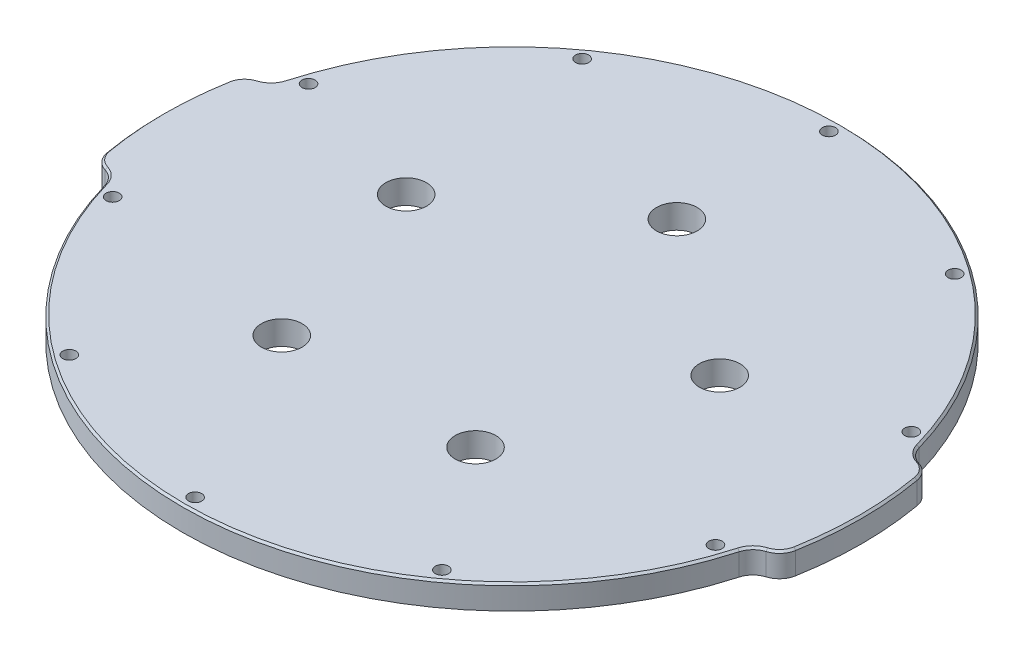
ISO-10303-21;
HEADER;
FILE_DESCRIPTION(('STEP AP214'),'2;1');
FILE_NAME('part.step','',(''),(''),'','','');
FILE_SCHEMA(('AUTOMOTIVE_DESIGN { 1 0 10303 214 1 1 1 1 }'));
ENDSEC;
DATA;
#1=APPLICATION_CONTEXT('core data for automotive mechanical design processes');
#2=APPLICATION_PROTOCOL_DEFINITION('international standard','automotive_design',2000,#1);
#3=PRODUCT_CONTEXT('',#1,'mechanical');
#4=PRODUCT('Part','Part','',(#3));
#5=PRODUCT_RELATED_PRODUCT_CATEGORY('part','',(#4));
#6=PRODUCT_DEFINITION_FORMATION('','',#4);
#7=PRODUCT_DEFINITION_CONTEXT('part definition',#1,'design');
#8=PRODUCT_DEFINITION('design','',#6,#7);
#9=PRODUCT_DEFINITION_SHAPE('','',#8);
#10=(LENGTH_UNIT() NAMED_UNIT(*) SI_UNIT(.MILLI.,.METRE.));
#11=(NAMED_UNIT(*) PLANE_ANGLE_UNIT() SI_UNIT($,.RADIAN.));
#12=(NAMED_UNIT(*) SI_UNIT($,.STERADIAN.) SOLID_ANGLE_UNIT());
#13=UNCERTAINTY_MEASURE_WITH_UNIT(LENGTH_MEASURE(1.E-05),#10,'distance_accuracy_value','');
#14=(GEOMETRIC_REPRESENTATION_CONTEXT(3) GLOBAL_UNCERTAINTY_ASSIGNED_CONTEXT((#13)) GLOBAL_UNIT_ASSIGNED_CONTEXT((#10,
#11,#12)) REPRESENTATION_CONTEXT('',''));
#15=CARTESIAN_POINT('',(0.,0.,0.));
#16=DIRECTION('',(0.,0.,1.));
#17=DIRECTION('',(1.,0.,0.));
#18=AXIS2_PLACEMENT_3D('',#15,#16,#17);
#19=CARTESIAN_POINT('',(-40.6479400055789,6.,-7.16732853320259));
#20=DIRECTION('',(0.,-1.,0.));
#21=DIRECTION('',(0.,0.,-1.));
#22=AXIS2_PLACEMENT_3D('',#19,#20,#21);
#23=PLANE('',#22);
#24=CARTESIAN_POINT('',(84.2258492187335,6.,-23.8957909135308));
#25=DIRECTION('',(0.,-1.,0.));
#26=DIRECTION('',(0.,0.,-1.));
#27=AXIS2_PLACEMENT_3D('',#24,#25,#26);
#28=CIRCLE('',#27,5.50000000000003);
#29=CARTESIAN_POINT('',(82.6143661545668,6.,-18.6371672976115));
#30=VERTEX_POINT('',#29);
#31=CARTESIAN_POINT('',(78.9346765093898,6.,-22.3946275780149));
#32=VERTEX_POINT('',#31);
#33=EDGE_CURVE('E295',#30,#32,#28,.T.);
#34=ORIENTED_EDGE('',*,*,#33,.T.);
#35=CARTESIAN_POINT('',(0.,6.,0.));
#36=DIRECTION('',(0.,-1.,0.));
#37=DIRECTION('',(0.,0.,-1.));
#38=AXIS2_PLACEMENT_3D('',#35,#36,#37);
#39=CIRCLE('',#38,82.05);
#40=CARTESIAN_POINT('',(-78.9346765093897,6.,-22.3946275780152));
#41=VERTEX_POINT('',#40);
#42=EDGE_CURVE('E301',#32,#41,#39,.F.);
#43=ORIENTED_EDGE('',*,*,#42,.T.);
#44=CARTESIAN_POINT('',(-84.2258492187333,6.,-23.8957909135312));
#45=DIRECTION('',(0.,-1.,0.));
#46=DIRECTION('',(0.,0.,-1.));
#47=AXIS2_PLACEMENT_3D('',#44,#45,#46);
#48=CIRCLE('',#47,5.50000000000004);
#49=CARTESIAN_POINT('',(-82.6143661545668,6.,-18.6371672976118));
#50=VERTEX_POINT('',#49);
#51=EDGE_CURVE('E298',#41,#50,#48,.T.);
#52=ORIENTED_EDGE('',*,*,#51,.T.);
#53=CARTESIAN_POINT('',(-81.2958800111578,6.,-14.3346570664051));
#54=DIRECTION('',(0.,-1.,0.));
#55=DIRECTION('',(0.,0.,-1.));
#56=AXIS2_PLACEMENT_3D('',#53,#54,#55);
#57=CIRCLE('',#56,4.49999999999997);
#58=CARTESIAN_POINT('',(-85.7275148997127,6.,-15.1160738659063));
#59=VERTEX_POINT('',#58);
#60=EDGE_CURVE('E292',#50,#59,#57,.F.);
#61=ORIENTED_EDGE('',*,*,#60,.T.);
#62=CARTESIAN_POINT('',(0.,6.,0.));
#63=DIRECTION('',(0.,-1.,0.));
#64=DIRECTION('',(0.,0.,-1.));
#65=AXIS2_PLACEMENT_3D('',#62,#63,#64);
#66=CIRCLE('',#65,87.05);
#67=CARTESIAN_POINT('',(-85.7275148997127,6.,15.1160738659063));
#68=VERTEX_POINT('',#67);
#69=EDGE_CURVE('E286',#59,#68,#66,.F.);
#70=ORIENTED_EDGE('',*,*,#69,.T.);
#71=CARTESIAN_POINT('',(-81.2958800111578,6.,14.3346570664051));
#72=DIRECTION('',(0.,-1.,0.));
#73=DIRECTION('',(0.,0.,-1.));
#74=AXIS2_PLACEMENT_3D('',#71,#72,#73);
#75=CIRCLE('',#74,4.49999999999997);
#76=CARTESIAN_POINT('',(-82.6143661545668,6.,18.6371672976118));
#77=VERTEX_POINT('',#76);
#78=EDGE_CURVE('E281',#68,#77,#75,.F.);
#79=ORIENTED_EDGE('',*,*,#78,.T.);
#80=CARTESIAN_POINT('',(-84.2258492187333,6.,23.8957909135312));
#81=DIRECTION('',(0.,-1.,0.));
#82=DIRECTION('',(0.,0.,-1.));
#83=AXIS2_PLACEMENT_3D('',#80,#81,#82);
#84=CIRCLE('',#83,5.50000000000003);
#85=CARTESIAN_POINT('',(-78.9346765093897,6.,22.3946275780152));
#86=VERTEX_POINT('',#85);
#87=EDGE_CURVE('E275',#77,#86,#84,.T.);
#88=ORIENTED_EDGE('',*,*,#87,.T.);
#89=CARTESIAN_POINT('',(0.,6.,-4.92661467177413E-13));
#90=DIRECTION('',(0.,-1.,0.));
#91=DIRECTION('',(0.,0.,-1.));
#92=AXIS2_PLACEMENT_3D('',#89,#90,#91);
#93=CIRCLE('',#92,82.0500000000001);
#94=CARTESIAN_POINT('',(78.9346765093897,6.,22.3946275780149));
#95=VERTEX_POINT('',#94);
#96=EDGE_CURVE('E269',#86,#95,#93,.F.);
#97=ORIENTED_EDGE('',*,*,#96,.T.);
#98=CARTESIAN_POINT('',(84.2258492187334,6.,23.8957909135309));
#99=DIRECTION('',(0.,-1.,0.));
#100=DIRECTION('',(0.,0.,-1.));
#101=AXIS2_PLACEMENT_3D('',#98,#99,#100);
#102=CIRCLE('',#101,5.50000000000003);
#103=CARTESIAN_POINT('',(82.6143661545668,6.,18.6371672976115));
#104=VERTEX_POINT('',#103);
#105=EDGE_CURVE('E272',#95,#104,#102,.T.);
#106=ORIENTED_EDGE('',*,*,#105,.T.);
#107=CARTESIAN_POINT('',(81.2958800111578,6.,14.3346570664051));
#108=DIRECTION('',(0.,-1.,0.));
#109=DIRECTION('',(0.,0.,-1.));
#110=AXIS2_PLACEMENT_3D('',#107,#108,#109);
#111=CIRCLE('',#110,4.49999999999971);
#112=CARTESIAN_POINT('',(85.7275148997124,6.,15.1160738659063));
#113=VERTEX_POINT('',#112);
#114=EDGE_CURVE('E278',#104,#113,#111,.F.);
#115=ORIENTED_EDGE('',*,*,#114,.T.);
#116=CARTESIAN_POINT('',(-1.29063426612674E-12,6.,0.));
#117=DIRECTION('',(0.,-1.,0.));
#118=DIRECTION('',(0.,0.,-1.));
#119=AXIS2_PLACEMENT_3D('',#116,#117,#118);
#120=CIRCLE('',#119,87.050000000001);
#121=CARTESIAN_POINT('',(85.7275148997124,6.,-15.1160738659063));
#122=VERTEX_POINT('',#121);
#123=EDGE_CURVE('E284',#113,#122,#120,.F.);
#124=ORIENTED_EDGE('',*,*,#123,.T.);
#125=CARTESIAN_POINT('',(81.2958800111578,6.,-14.3346570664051));
#126=DIRECTION('',(0.,-1.,0.));
#127=DIRECTION('',(0.,0.,-1.));
#128=AXIS2_PLACEMENT_3D('',#125,#126,#127);
#129=CIRCLE('',#128,4.49999999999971);
#130=EDGE_CURVE('E289',#122,#30,#129,.F.);
#131=ORIENTED_EDGE('',*,*,#130,.T.);
#132=EDGE_LOOP('',(#34,#43,#52,#61,#70,#79,#88,#97,#106,#115,#124,#131));
#133=FACE_BOUND('',#132,.T.);
#134=CARTESIAN_POINT('',(-39.2548577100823,6.,-12.7546764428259));
#135=DIRECTION('',(0.,1.,0.));
#136=DIRECTION('',(0.,0.,1.));
#137=AXIS2_PLACEMENT_3D('',#134,#135,#136);
#138=CIRCLE('',#137,5.1);
#139=CARTESIAN_POINT('',(-39.2548577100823,6.,-7.65467644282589));
#140=VERTEX_POINT('',#139);
#141=EDGE_CURVE('E384',#140,#140,#138,.T.);
#142=ORIENTED_EDGE('',*,*,#141,.F.);
#143=EDGE_LOOP('',(#142));
#144=FACE_BOUND('',#143,.T.);
#145=CARTESIAN_POINT('',(-24.2608362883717,6.,33.3921764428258));
#146=DIRECTION('',(0.,1.,0.));
#147=DIRECTION('',(0.,0.,1.));
#148=AXIS2_PLACEMENT_3D('',#145,#146,#147);
#149=CIRCLE('',#148,5.1);
#150=CARTESIAN_POINT('',(-24.2608362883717,6.,38.4921764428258));
#151=VERTEX_POINT('',#150);
#152=EDGE_CURVE('E397',#151,#151,#149,.T.);
#153=ORIENTED_EDGE('',*,*,#152,.F.);
#154=EDGE_LOOP('',(#153));
#155=FACE_BOUND('',#154,.T.);
#156=CARTESIAN_POINT('',(24.2608362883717,6.,33.3921764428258));
#157=DIRECTION('',(0.,1.,0.));
#158=DIRECTION('',(0.,0.,1.));
#159=AXIS2_PLACEMENT_3D('',#156,#157,#158);
#160=CIRCLE('',#159,5.1);
#161=CARTESIAN_POINT('',(24.2608362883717,6.,38.4921764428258));
#162=VERTEX_POINT('',#161);
#163=EDGE_CURVE('E404',#162,#162,#160,.T.);
#164=ORIENTED_EDGE('',*,*,#163,.F.);
#165=EDGE_LOOP('',(#164));
#166=FACE_BOUND('',#165,.T.);
#167=CARTESIAN_POINT('',(39.2548577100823,6.,-12.7546764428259));
#168=DIRECTION('',(0.,1.,0.));
#169=DIRECTION('',(0.,0.,1.));
#170=AXIS2_PLACEMENT_3D('',#167,#168,#169);
#171=CIRCLE('',#170,5.09999999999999);
#172=CARTESIAN_POINT('',(39.2548577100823,6.,-7.65467644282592));
#173=VERTEX_POINT('',#172);
#174=EDGE_CURVE('E411',#173,#173,#171,.T.);
#175=ORIENTED_EDGE('',*,*,#174,.F.);
#176=EDGE_LOOP('',(#175));
#177=FACE_BOUND('',#176,.T.);
#178=CARTESIAN_POINT('',(0.,6.,-41.2749999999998));
#179=DIRECTION('',(0.,1.,0.));
#180=DIRECTION('',(0.,0.,1.));
#181=AXIS2_PLACEMENT_3D('',#178,#179,#180);
#182=CIRCLE('',#181,5.1);
#183=CARTESIAN_POINT('',(0.,6.,-36.1749999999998));
#184=VERTEX_POINT('',#183);
#185=EDGE_CURVE('E419',#184,#184,#182,.T.);
#186=ORIENTED_EDGE('',*,*,#185,.F.);
#187=EDGE_LOOP('',(#186));
#188=FACE_BOUND('',#187,.T.);
#189=CARTESIAN_POINT('',(-75.4663345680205,6.,-24.5204985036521));
#190=DIRECTION('',(0.,1.,0.));
#191=DIRECTION('',(0.,0.,1.));
#192=AXIS2_PLACEMENT_3D('',#189,#190,#191);
#193=CIRCLE('',#192,1.6500000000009);
#194=CARTESIAN_POINT('',(-75.4663345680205,6.,-22.8704985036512));
#195=VERTEX_POINT('',#194);
#196=EDGE_CURVE('E439',#195,#195,#193,.T.);
#197=ORIENTED_EDGE('',*,*,#196,.F.);
#198=EDGE_LOOP('',(#197));
#199=FACE_BOUND('',#198,.T.);
#200=CARTESIAN_POINT('',(-46.6407597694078,6.,64.1954985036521));
#201=DIRECTION('',(0.,1.,0.));
#202=DIRECTION('',(0.,0.,1.));
#203=AXIS2_PLACEMENT_3D('',#200,#201,#202);
#204=CIRCLE('',#203,1.65000000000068);
#205=CARTESIAN_POINT('',(-46.6407597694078,6.,65.8454985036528));
#206=VERTEX_POINT('',#205);
#207=EDGE_CURVE('E455',#206,#206,#204,.T.);
#208=ORIENTED_EDGE('',*,*,#207,.F.);
#209=EDGE_LOOP('',(#208));
#210=FACE_BOUND('',#209,.T.);
#211=CARTESIAN_POINT('',(46.6407597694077,6.,64.1954985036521));
#212=DIRECTION('',(0.,1.,0.));
#213=DIRECTION('',(0.,0.,1.));
#214=AXIS2_PLACEMENT_3D('',#211,#212,#213);
#215=CIRCLE('',#214,1.65000000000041);
#216=CARTESIAN_POINT('',(46.6407597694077,6.,65.8454985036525));
#217=VERTEX_POINT('',#216);
#218=EDGE_CURVE('E471',#217,#217,#215,.T.);
#219=ORIENTED_EDGE('',*,*,#218,.F.);
#220=EDGE_LOOP('',(#219));
#221=FACE_BOUND('',#220,.T.);
#222=CARTESIAN_POINT('',(75.4663345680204,6.,-24.5204985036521));
#223=DIRECTION('',(0.,1.,0.));
#224=DIRECTION('',(0.,0.,1.));
#225=AXIS2_PLACEMENT_3D('',#222,#223,#224);
#226=CIRCLE('',#225,1.65000000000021);
#227=CARTESIAN_POINT('',(75.4663345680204,6.,-22.8704985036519));
#228=VERTEX_POINT('',#227);
#229=EDGE_CURVE('E487',#228,#228,#226,.T.);
#230=ORIENTED_EDGE('',*,*,#229,.F.);
#231=EDGE_LOOP('',(#230));
#232=FACE_BOUND('',#231,.T.);
#233=CARTESIAN_POINT('',(0.,6.,-79.35));
#234=DIRECTION('',(0.,1.,0.));
#235=DIRECTION('',(0.,0.,1.));
#236=AXIS2_PLACEMENT_3D('',#233,#234,#235);
#237=CIRCLE('',#236,1.65);
#238=CARTESIAN_POINT('',(0.,6.,-77.7));
#239=VERTEX_POINT('',#238);
#240=EDGE_CURVE('E191',#239,#239,#237,.T.);
#241=ORIENTED_EDGE('',*,*,#240,.F.);
#242=EDGE_LOOP('',(#241));
#243=FACE_BOUND('',#242,.T.);
#244=CARTESIAN_POINT('',(46.6407597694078,6.,-64.1954985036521));
#245=DIRECTION('',(0.,1.,0.));
#246=DIRECTION('',(0.,0.,1.));
#247=AXIS2_PLACEMENT_3D('',#244,#245,#246);
#248=CIRCLE('',#247,1.65000000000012);
#249=CARTESIAN_POINT('',(46.6407597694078,6.,-62.5454985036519));
#250=VERTEX_POINT('',#249);
#251=EDGE_CURVE('E495',#250,#250,#248,.T.);
#252=ORIENTED_EDGE('',*,*,#251,.F.);
#253=EDGE_LOOP('',(#252));
#254=FACE_BOUND('',#253,.T.);
#255=CARTESIAN_POINT('',(75.4663345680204,6.,24.5204985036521));
#256=DIRECTION('',(0.,1.,0.));
#257=DIRECTION('',(0.,0.,1.));
#258=AXIS2_PLACEMENT_3D('',#255,#256,#257);
#259=CIRCLE('',#258,1.65000000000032);
#260=CARTESIAN_POINT('',(75.4663345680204,6.,26.1704985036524));
#261=VERTEX_POINT('',#260);
#262=EDGE_CURVE('E479',#261,#261,#259,.T.);
#263=ORIENTED_EDGE('',*,*,#262,.F.);
#264=EDGE_LOOP('',(#263));
#265=FACE_BOUND('',#264,.T.);
#266=CARTESIAN_POINT('',(0.,6.,79.35));
#267=DIRECTION('',(0.,1.,0.));
#268=DIRECTION('',(0.,0.,1.));
#269=AXIS2_PLACEMENT_3D('',#266,#267,#268);
#270=CIRCLE('',#269,1.65000000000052);
#271=CARTESIAN_POINT('',(0.,6.,81.0000000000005));
#272=VERTEX_POINT('',#271);
#273=EDGE_CURVE('E463',#272,#272,#270,.T.);
#274=ORIENTED_EDGE('',*,*,#273,.F.);
#275=EDGE_LOOP('',(#274));
#276=FACE_BOUND('',#275,.T.);
#277=CARTESIAN_POINT('',(-75.4663345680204,6.,24.5204985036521));
#278=DIRECTION('',(0.,1.,0.));
#279=DIRECTION('',(0.,0.,1.));
#280=AXIS2_PLACEMENT_3D('',#277,#278,#279);
#281=CIRCLE('',#280,1.65000000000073);
#282=CARTESIAN_POINT('',(-75.4663345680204,6.,26.1704985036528));
#283=VERTEX_POINT('',#282);
#284=EDGE_CURVE('E447',#283,#283,#281,.T.);
#285=ORIENTED_EDGE('',*,*,#284,.F.);
#286=EDGE_LOOP('',(#285));
#287=FACE_BOUND('',#286,.T.);
#288=CARTESIAN_POINT('',(-46.6407597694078,6.,-64.1954985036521));
#289=DIRECTION('',(0.,1.,0.));
#290=DIRECTION('',(0.,0.,1.));
#291=AXIS2_PLACEMENT_3D('',#288,#289,#290);
#292=CIRCLE('',#291,1.65000000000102);
#293=CARTESIAN_POINT('',(-46.6407597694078,6.,-62.545498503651));
#294=VERTEX_POINT('',#293);
#295=EDGE_CURVE('E431',#294,#294,#292,.T.);
#296=ORIENTED_EDGE('',*,*,#295,.F.);
#297=EDGE_LOOP('',(#296));
#298=FACE_BOUND('',#297,.T.);
#299=ADVANCED_FACE('F41',(#133,#144,#155,#166,#177,#188,#199,#210,#221,#232,#243,#254,#265,#276,
#287,#298),#23,.F.);
#300=CARTESIAN_POINT('',(-40.6479400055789,0.,-7.16732853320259));
#301=DIRECTION('',(0.,-1.,0.));
#302=DIRECTION('',(0.,0.,-1.));
#303=AXIS2_PLACEMENT_3D('',#300,#301,#302);
#304=PLANE('',#303);
#305=CARTESIAN_POINT('',(-39.2548577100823,0.,-12.7546764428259));
#306=DIRECTION('',(0.,1.,0.));
#307=DIRECTION('',(0.,0.,1.));
#308=AXIS2_PLACEMENT_3D('',#305,#306,#307);
#309=CIRCLE('',#308,5.1);
#310=CARTESIAN_POINT('',(-39.2548577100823,0.,-7.65467644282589));
#311=VERTEX_POINT('',#310);
#312=EDGE_CURVE('E390',#311,#311,#309,.T.);
#313=ORIENTED_EDGE('',*,*,#312,.T.);
#314=EDGE_LOOP('',(#313));
#315=FACE_BOUND('',#314,.T.);
#316=CARTESIAN_POINT('',(-24.2608362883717,0.,33.3921764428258));
#317=DIRECTION('',(0.,1.,0.));
#318=DIRECTION('',(0.,0.,1.));
#319=AXIS2_PLACEMENT_3D('',#316,#317,#318);
#320=CIRCLE('',#319,5.1);
#321=CARTESIAN_POINT('',(-24.2608362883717,0.,38.4921764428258));
#322=VERTEX_POINT('',#321);
#323=EDGE_CURVE('E400',#322,#322,#320,.T.);
#324=ORIENTED_EDGE('',*,*,#323,.T.);
#325=EDGE_LOOP('',(#324));
#326=FACE_BOUND('',#325,.T.);
#327=CARTESIAN_POINT('',(24.2608362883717,0.,33.3921764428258));
#328=DIRECTION('',(0.,1.,0.));
#329=DIRECTION('',(0.,0.,1.));
#330=AXIS2_PLACEMENT_3D('',#327,#328,#329);
#331=CIRCLE('',#330,5.1);
#332=CARTESIAN_POINT('',(24.2608362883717,0.,38.4921764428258));
#333=VERTEX_POINT('',#332);
#334=EDGE_CURVE('E408',#333,#333,#331,.T.);
#335=ORIENTED_EDGE('',*,*,#334,.T.);
#336=EDGE_LOOP('',(#335));
#337=FACE_BOUND('',#336,.T.);
#338=CARTESIAN_POINT('',(39.2548577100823,0.,-12.7546764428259));
#339=DIRECTION('',(0.,1.,0.));
#340=DIRECTION('',(0.,0.,1.));
#341=AXIS2_PLACEMENT_3D('',#338,#339,#340);
#342=CIRCLE('',#341,5.09999999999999);
#343=CARTESIAN_POINT('',(39.2548577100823,0.,-7.65467644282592));
#344=VERTEX_POINT('',#343);
#345=EDGE_CURVE('E415',#344,#344,#342,.T.);
#346=ORIENTED_EDGE('',*,*,#345,.T.);
#347=EDGE_LOOP('',(#346));
#348=FACE_BOUND('',#347,.T.);
#349=CARTESIAN_POINT('',(0.,0.,-41.2749999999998));
#350=DIRECTION('',(0.,1.,0.));
#351=DIRECTION('',(0.,0.,1.));
#352=AXIS2_PLACEMENT_3D('',#349,#350,#351);
#353=CIRCLE('',#352,5.1);
#354=CARTESIAN_POINT('',(0.,0.,-36.1749999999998));
#355=VERTEX_POINT('',#354);
#356=EDGE_CURVE('E423',#355,#355,#353,.T.);
#357=ORIENTED_EDGE('',*,*,#356,.T.);
#358=EDGE_LOOP('',(#357));
#359=FACE_BOUND('',#358,.T.);
#360=CARTESIAN_POINT('',(-75.4663345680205,0.,-24.5204985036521));
#361=DIRECTION('',(0.,1.,0.));
#362=DIRECTION('',(0.,0.,1.));
#363=AXIS2_PLACEMENT_3D('',#360,#361,#362);
#364=CIRCLE('',#363,1.6500000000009);
#365=CARTESIAN_POINT('',(-75.4663345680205,0.,-22.8704985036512));
#366=VERTEX_POINT('',#365);
#367=EDGE_CURVE('E435',#366,#366,#364,.T.);
#368=ORIENTED_EDGE('',*,*,#367,.T.);
#369=EDGE_LOOP('',(#368));
#370=FACE_BOUND('',#369,.T.);
#371=CARTESIAN_POINT('',(-46.6407597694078,0.,64.1954985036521));
#372=DIRECTION('',(0.,1.,0.));
#373=DIRECTION('',(0.,0.,1.));
#374=AXIS2_PLACEMENT_3D('',#371,#372,#373);
#375=CIRCLE('',#374,1.65000000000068);
#376=CARTESIAN_POINT('',(-46.6407597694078,0.,65.8454985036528));
#377=VERTEX_POINT('',#376);
#378=EDGE_CURVE('E451',#377,#377,#375,.T.);
#379=ORIENTED_EDGE('',*,*,#378,.T.);
#380=EDGE_LOOP('',(#379));
#381=FACE_BOUND('',#380,.T.);
#382=CARTESIAN_POINT('',(46.6407597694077,0.,64.1954985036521));
#383=DIRECTION('',(0.,1.,0.));
#384=DIRECTION('',(0.,0.,1.));
#385=AXIS2_PLACEMENT_3D('',#382,#383,#384);
#386=CIRCLE('',#385,1.65000000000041);
#387=CARTESIAN_POINT('',(46.6407597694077,0.,65.8454985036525));
#388=VERTEX_POINT('',#387);
#389=EDGE_CURVE('E467',#388,#388,#386,.T.);
#390=ORIENTED_EDGE('',*,*,#389,.T.);
#391=EDGE_LOOP('',(#390));
#392=FACE_BOUND('',#391,.T.);
#393=CARTESIAN_POINT('',(75.4663345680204,0.,-24.5204985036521));
#394=DIRECTION('',(0.,1.,0.));
#395=DIRECTION('',(0.,0.,1.));
#396=AXIS2_PLACEMENT_3D('',#393,#394,#395);
#397=CIRCLE('',#396,1.65000000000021);
#398=CARTESIAN_POINT('',(75.4663345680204,0.,-22.8704985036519));
#399=VERTEX_POINT('',#398);
#400=EDGE_CURVE('E483',#399,#399,#397,.T.);
#401=ORIENTED_EDGE('',*,*,#400,.T.);
#402=EDGE_LOOP('',(#401));
#403=FACE_BOUND('',#402,.T.);
#404=CARTESIAN_POINT('',(0.,0.,-79.35));
#405=DIRECTION('',(0.,1.,0.));
#406=DIRECTION('',(0.,0.,1.));
#407=AXIS2_PLACEMENT_3D('',#404,#405,#406);
#408=CIRCLE('',#407,1.65);
#409=CARTESIAN_POINT('',(0.,0.,-77.7));
#410=VERTEX_POINT('',#409);
#411=EDGE_CURVE('E499',#410,#410,#408,.T.);
#412=ORIENTED_EDGE('',*,*,#411,.T.);
#413=EDGE_LOOP('',(#412));
#414=FACE_BOUND('',#413,.T.);
#415=CARTESIAN_POINT('',(-81.2958800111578,0.,-14.3346570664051));
#416=DIRECTION('',(0.,1.,0.));
#417=DIRECTION('',(0.,0.,-1.));
#418=AXIS2_PLACEMENT_3D('',#415,#416,#417);
#419=CIRCLE('',#418,5.00000000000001);
#420=CARTESIAN_POINT('',(-82.7608646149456,0.,-19.1152239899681));
#421=VERTEX_POINT('',#420);
#422=CARTESIAN_POINT('',(-86.2199187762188,0.,-15.2028979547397));
#423=VERTEX_POINT('',#422);
#424=EDGE_CURVE('E184',#421,#423,#419,.T.);
#425=ORIENTED_EDGE('',*,*,#424,.F.);
#426=CARTESIAN_POINT('',(-84.2258492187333,0.,-23.8957909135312));
#427=DIRECTION('',(0.,-1.,0.));
#428=DIRECTION('',(0.,0.,-1.));
#429=AXIS2_PLACEMENT_3D('',#426,#427,#428);
#430=CIRCLE('',#429,5.);
#431=CARTESIAN_POINT('',(-79.4156922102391,0.,-22.531096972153));
#432=VERTEX_POINT('',#431);
#433=EDGE_CURVE('E263',#421,#432,#430,.F.);
#434=ORIENTED_EDGE('',*,*,#433,.T.);
#435=CARTESIAN_POINT('',(0.,0.,0.));
#436=DIRECTION('',(0.,1.,0.));
#437=DIRECTION('',(0.,0.,-1.));
#438=AXIS2_PLACEMENT_3D('',#435,#436,#437);
#439=CIRCLE('',#438,82.55);
#440=CARTESIAN_POINT('',(79.4156922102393,0.,-22.5310969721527));
#441=VERTEX_POINT('',#440);
#442=EDGE_CURVE('E220',#441,#432,#439,.T.);
#443=ORIENTED_EDGE('',*,*,#442,.F.);
#444=CARTESIAN_POINT('',(84.2258492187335,0.,-23.8957909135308));
#445=DIRECTION('',(0.,-1.,0.));
#446=DIRECTION('',(0.,0.,-1.));
#447=AXIS2_PLACEMENT_3D('',#444,#445,#446);
#448=CIRCLE('',#447,5.);
#449=CARTESIAN_POINT('',(82.7608646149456,0.,-19.1152239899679));
#450=VERTEX_POINT('',#449);
#451=EDGE_CURVE('E260',#441,#450,#448,.F.);
#452=ORIENTED_EDGE('',*,*,#451,.T.);
#453=CARTESIAN_POINT('',(81.2958800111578,0.,-14.3346570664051));
#454=DIRECTION('',(0.,1.,0.));
#455=DIRECTION('',(0.,0.,1.));
#456=AXIS2_PLACEMENT_3D('',#453,#454,#455);
#457=CIRCLE('',#456,4.99999999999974);
#458=CARTESIAN_POINT('',(86.2199187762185,0.,-15.2028979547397));
#459=VERTEX_POINT('',#458);
#460=EDGE_CURVE('E216',#459,#450,#457,.T.);
#461=ORIENTED_EDGE('',*,*,#460,.F.);
#462=CARTESIAN_POINT('',(-1.29063426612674E-12,0.,0.));
#463=DIRECTION('',(0.,1.,0.));
#464=DIRECTION('',(0.,0.,1.));
#465=AXIS2_PLACEMENT_3D('',#462,#463,#464);
#466=CIRCLE('',#465,87.550000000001);
#467=CARTESIAN_POINT('',(86.2199187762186,0.,15.2028979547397));
#468=VERTEX_POINT('',#467);
#469=EDGE_CURVE('E212',#468,#459,#466,.T.);
#470=ORIENTED_EDGE('',*,*,#469,.F.);
#471=CARTESIAN_POINT('',(81.2958800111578,0.,14.3346570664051));
#472=DIRECTION('',(0.,1.,0.));
#473=DIRECTION('',(0.,0.,-1.));
#474=AXIS2_PLACEMENT_3D('',#471,#472,#473);
#475=CIRCLE('',#474,4.99999999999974);
#476=CARTESIAN_POINT('',(82.7608646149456,0.,19.1152239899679));
#477=VERTEX_POINT('',#476);
#478=EDGE_CURVE('E208',#477,#468,#475,.T.);
#479=ORIENTED_EDGE('',*,*,#478,.F.);
#480=CARTESIAN_POINT('',(84.2258492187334,0.,23.8957909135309));
#481=DIRECTION('',(0.,-1.,0.));
#482=DIRECTION('',(0.,0.,-1.));
#483=AXIS2_PLACEMENT_3D('',#480,#481,#482);
#484=CIRCLE('',#483,5.);
#485=CARTESIAN_POINT('',(79.4156922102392,0.,22.5310969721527));
#486=VERTEX_POINT('',#485);
#487=EDGE_CURVE('E257',#477,#486,#484,.F.);
#488=ORIENTED_EDGE('',*,*,#487,.T.);
#489=CARTESIAN_POINT('',(0.,0.,-4.92661467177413E-13));
#490=DIRECTION('',(0.,1.,0.));
#491=DIRECTION('',(0.,0.,-1.));
#492=AXIS2_PLACEMENT_3D('',#489,#490,#491);
#493=CIRCLE('',#492,82.5500000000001);
#494=CARTESIAN_POINT('',(-79.4156922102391,0.,22.531096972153));
#495=VERTEX_POINT('',#494);
#496=EDGE_CURVE('E201',#495,#486,#493,.T.);
#497=ORIENTED_EDGE('',*,*,#496,.F.);
#498=CARTESIAN_POINT('',(-84.2258492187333,0.,23.8957909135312));
#499=DIRECTION('',(0.,-1.,0.));
#500=DIRECTION('',(0.,0.,-1.));
#501=AXIS2_PLACEMENT_3D('',#498,#499,#500);
#502=CIRCLE('',#501,5.);
#503=CARTESIAN_POINT('',(-82.7608646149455,0.,19.1152239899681));
#504=VERTEX_POINT('',#503);
#505=EDGE_CURVE('E266',#495,#504,#502,.F.);
#506=ORIENTED_EDGE('',*,*,#505,.T.);
#507=CARTESIAN_POINT('',(-81.2958800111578,0.,14.3346570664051));
#508=DIRECTION('',(0.,1.,0.));
#509=DIRECTION('',(0.,0.,1.));
#510=AXIS2_PLACEMENT_3D('',#507,#508,#509);
#511=CIRCLE('',#510,5.00000000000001);
#512=CARTESIAN_POINT('',(-86.2199187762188,0.,15.2028979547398));
#513=VERTEX_POINT('',#512);
#514=EDGE_CURVE('E196',#513,#504,#511,.T.);
#515=ORIENTED_EDGE('',*,*,#514,.F.);
#516=CARTESIAN_POINT('',(0.,0.,0.));
#517=DIRECTION('',(0.,1.,0.));
#518=DIRECTION('',(0.,0.,-1.));
#519=AXIS2_PLACEMENT_3D('',#516,#517,#518);
#520=CIRCLE('',#519,87.55);
#521=EDGE_CURVE('E173',#423,#513,#520,.T.);
#522=ORIENTED_EDGE('',*,*,#521,.F.);
#523=EDGE_LOOP('',(#425,#434,#443,#452,#461,#470,#479,#488,#497,#506,#515,#522));
#524=FACE_BOUND('',#523,.T.);
#525=CARTESIAN_POINT('',(46.6407597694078,0.,-64.1954985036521));
#526=DIRECTION('',(0.,1.,0.));
#527=DIRECTION('',(0.,0.,1.));
#528=AXIS2_PLACEMENT_3D('',#525,#526,#527);
#529=CIRCLE('',#528,1.65000000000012);
#530=CARTESIAN_POINT('',(46.6407597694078,0.,-62.5454985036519));
#531=VERTEX_POINT('',#530);
#532=EDGE_CURVE('E491',#531,#531,#529,.T.);
#533=ORIENTED_EDGE('',*,*,#532,.T.);
#534=EDGE_LOOP('',(#533));
#535=FACE_BOUND('',#534,.T.);
#536=CARTESIAN_POINT('',(75.4663345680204,0.,24.5204985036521));
#537=DIRECTION('',(0.,1.,0.));
#538=DIRECTION('',(0.,0.,1.));
#539=AXIS2_PLACEMENT_3D('',#536,#537,#538);
#540=CIRCLE('',#539,1.65000000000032);
#541=CARTESIAN_POINT('',(75.4663345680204,0.,26.1704985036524));
#542=VERTEX_POINT('',#541);
#543=EDGE_CURVE('E475',#542,#542,#540,.T.);
#544=ORIENTED_EDGE('',*,*,#543,.T.);
#545=EDGE_LOOP('',(#544));
#546=FACE_BOUND('',#545,.T.);
#547=CARTESIAN_POINT('',(0.,0.,79.35));
#548=DIRECTION('',(0.,1.,0.));
#549=DIRECTION('',(0.,0.,1.));
#550=AXIS2_PLACEMENT_3D('',#547,#548,#549);
#551=CIRCLE('',#550,1.65000000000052);
#552=CARTESIAN_POINT('',(0.,0.,81.0000000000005));
#553=VERTEX_POINT('',#552);
#554=EDGE_CURVE('E459',#553,#553,#551,.T.);
#555=ORIENTED_EDGE('',*,*,#554,.T.);
#556=EDGE_LOOP('',(#555));
#557=FACE_BOUND('',#556,.T.);
#558=CARTESIAN_POINT('',(-75.4663345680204,0.,24.5204985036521));
#559=DIRECTION('',(0.,1.,0.));
#560=DIRECTION('',(0.,0.,1.));
#561=AXIS2_PLACEMENT_3D('',#558,#559,#560);
#562=CIRCLE('',#561,1.65000000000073);
#563=CARTESIAN_POINT('',(-75.4663345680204,0.,26.1704985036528));
#564=VERTEX_POINT('',#563);
#565=EDGE_CURVE('E443',#564,#564,#562,.T.);
#566=ORIENTED_EDGE('',*,*,#565,.T.);
#567=EDGE_LOOP('',(#566));
#568=FACE_BOUND('',#567,.T.);
#569=CARTESIAN_POINT('',(-46.6407597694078,0.,-64.1954985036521));
#570=DIRECTION('',(0.,1.,0.));
#571=DIRECTION('',(0.,0.,1.));
#572=AXIS2_PLACEMENT_3D('',#569,#570,#571);
#573=CIRCLE('',#572,1.65000000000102);
#574=CARTESIAN_POINT('',(-46.6407597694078,0.,-62.545498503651));
#575=VERTEX_POINT('',#574);
#576=EDGE_CURVE('E427',#575,#575,#573,.T.);
#577=ORIENTED_EDGE('',*,*,#576,.T.);
#578=EDGE_LOOP('',(#577));
#579=FACE_BOUND('',#578,.T.);
#580=ADVANCED_FACE('F193',(#315,#326,#337,#348,#359,#370,#381,#392,#403,#414,#524,#535,#546,
#557,#568,#579),#304,.T.);
#581=CARTESIAN_POINT('',(-81.2958800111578,6.,-14.3346570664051));
#582=DIRECTION('',(0.,-1.,0.));
#583=DIRECTION('',(0.,0.,-1.));
#584=AXIS2_PLACEMENT_3D('',#581,#582,#583);
#585=CYLINDRICAL_SURFACE('',#584,5.00000000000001);
#586=DIRECTION('',(0.,-1.,0.));
#587=VECTOR('',#586,1.);
#588=CARTESIAN_POINT('',(-86.2199187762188,6.,-15.2028979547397));
#589=LINE('',#588,#587);
#590=CARTESIAN_POINT('',(-86.2199187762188,5.49999999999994,-15.2028979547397));
#591=VERTEX_POINT('',#590);
#592=EDGE_CURVE('E168',#591,#423,#589,.T.);
#593=ORIENTED_EDGE('',*,*,#592,.F.);
#594=CARTESIAN_POINT('',(-81.2958800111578,5.49999999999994,-14.3346570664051));
#595=DIRECTION('',(0.,-1.,0.));
#596=DIRECTION('',(0.,0.,-1.));
#597=AXIS2_PLACEMENT_3D('',#594,#595,#596);
#598=CIRCLE('',#597,5.00000000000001);
#599=CARTESIAN_POINT('',(-82.7608646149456,5.49999999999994,-19.1152239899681));
#600=VERTEX_POINT('',#599);
#601=EDGE_CURVE('E315',#591,#600,#598,.T.);
#602=ORIENTED_EDGE('',*,*,#601,.T.);
#603=DIRECTION('',(0.,-1.,0.));
#604=VECTOR('',#603,1.);
#605=CARTESIAN_POINT('',(-82.7608646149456,6.,-19.1152239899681));
#606=LINE('',#605,#604);
#607=EDGE_CURVE('E187',#600,#421,#606,.T.);
#608=ORIENTED_EDGE('',*,*,#607,.T.);
#609=ORIENTED_EDGE('',*,*,#424,.T.);
#610=EDGE_LOOP('',(#593,#602,#608,#609));
#611=FACE_BOUND('',#610,.T.);
#612=ADVANCED_FACE('F185',(#611),#585,.T.);
#613=CARTESIAN_POINT('',(0.,6.,0.));
#614=DIRECTION('',(0.,-1.,0.));
#615=DIRECTION('',(0.,0.,-1.));
#616=AXIS2_PLACEMENT_3D('',#613,#614,#615);
#617=CYLINDRICAL_SURFACE('',#616,87.55);
#618=DIRECTION('',(0.,-1.,0.));
#619=VECTOR('',#618,1.);
#620=CARTESIAN_POINT('',(-86.2199187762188,6.,15.2028979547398));
#621=LINE('',#620,#619);
#622=CARTESIAN_POINT('',(-86.2199187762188,5.49999999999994,15.2028979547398));
#623=VERTEX_POINT('',#622);
#624=EDGE_CURVE('E181',#623,#513,#621,.T.);
#625=ORIENTED_EDGE('',*,*,#624,.F.);
#626=CARTESIAN_POINT('',(0.,5.49999999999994,0.));
#627=DIRECTION('',(0.,-1.,0.));
#628=DIRECTION('',(0.,0.,-1.));
#629=AXIS2_PLACEMENT_3D('',#626,#627,#628);
#630=CIRCLE('',#629,87.55);
#631=EDGE_CURVE('E176',#623,#591,#630,.T.);
#632=ORIENTED_EDGE('',*,*,#631,.T.);
#633=ORIENTED_EDGE('',*,*,#592,.T.);
#634=ORIENTED_EDGE('',*,*,#521,.T.);
#635=EDGE_LOOP('',(#625,#632,#633,#634));
#636=FACE_BOUND('',#635,.T.);
#637=ADVANCED_FACE('F171',(#636),#617,.T.);
#638=CARTESIAN_POINT('',(-81.2958800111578,6.,14.3346570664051));
#639=DIRECTION('',(0.,-1.,0.));
#640=DIRECTION('',(0.,0.,-1.));
#641=AXIS2_PLACEMENT_3D('',#638,#639,#640);
#642=CYLINDRICAL_SURFACE('',#641,5.00000000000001);
#643=DIRECTION('',(0.,-1.,0.));
#644=VECTOR('',#643,1.);
#645=CARTESIAN_POINT('',(-82.7608646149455,6.,19.1152239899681));
#646=LINE('',#645,#644);
#647=CARTESIAN_POINT('',(-82.7608646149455,5.49999999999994,19.1152239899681));
#648=VERTEX_POINT('',#647);
#649=EDGE_CURVE('E253',#504,#648,#646,.F.);
#650=ORIENTED_EDGE('',*,*,#649,.T.);
#651=CARTESIAN_POINT('',(-81.2958800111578,5.49999999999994,14.3346570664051));
#652=DIRECTION('',(0.,-1.,0.));
#653=DIRECTION('',(0.,0.,-1.));
#654=AXIS2_PLACEMENT_3D('',#651,#652,#653);
#655=CIRCLE('',#654,5.00000000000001);
#656=EDGE_CURVE('E326',#648,#623,#655,.T.);
#657=ORIENTED_EDGE('',*,*,#656,.T.);
#658=ORIENTED_EDGE('',*,*,#624,.T.);
#659=ORIENTED_EDGE('',*,*,#514,.T.);
#660=EDGE_LOOP('',(#650,#657,#658,#659));
#661=FACE_BOUND('',#660,.T.);
#662=ADVANCED_FACE('F549',(#661),#642,.T.);
#663=CARTESIAN_POINT('',(0.,6.,-4.92661467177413E-13));
#664=DIRECTION('',(0.,-1.,0.));
#665=DIRECTION('',(0.,0.,-1.));
#666=AXIS2_PLACEMENT_3D('',#663,#664,#665);
#667=CYLINDRICAL_SURFACE('',#666,82.5500000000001);
#668=DIRECTION('',(0.,-1.,0.));
#669=VECTOR('',#668,1.);
#670=CARTESIAN_POINT('',(79.4156922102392,6.,22.5310969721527));
#671=LINE('',#670,#669);
#672=CARTESIAN_POINT('',(79.4156922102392,5.49999999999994,22.5310969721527));
#673=VERTEX_POINT('',#672);
#674=EDGE_CURVE('E237',#486,#673,#671,.F.);
#675=ORIENTED_EDGE('',*,*,#674,.T.);
#676=CARTESIAN_POINT('',(0.,5.49999999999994,-4.92661467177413E-13));
#677=DIRECTION('',(0.,-1.,0.));
#678=DIRECTION('',(0.,0.,-1.));
#679=AXIS2_PLACEMENT_3D('',#676,#677,#678);
#680=CIRCLE('',#679,82.5500000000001);
#681=CARTESIAN_POINT('',(-79.4156922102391,5.49999999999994,22.531096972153));
#682=VERTEX_POINT('',#681);
#683=EDGE_CURVE('E11',#673,#682,#680,.T.);
#684=ORIENTED_EDGE('',*,*,#683,.T.);
#685=DIRECTION('',(0.,-1.,0.));
#686=VECTOR('',#685,1.);
#687=CARTESIAN_POINT('',(-79.4156922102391,6.,22.531096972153));
#688=LINE('',#687,#686);
#689=EDGE_CURVE('E234',#682,#495,#688,.T.);
#690=ORIENTED_EDGE('',*,*,#689,.T.);
#691=ORIENTED_EDGE('',*,*,#496,.T.);
#692=EDGE_LOOP('',(#675,#684,#690,#691));
#693=FACE_BOUND('',#692,.T.);
#694=ADVANCED_FACE('F545',(#693),#667,.T.);
#695=CARTESIAN_POINT('',(81.2958800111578,6.,14.3346570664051));
#696=DIRECTION('',(0.,-1.,0.));
#697=DIRECTION('',(0.,0.,-1.));
#698=AXIS2_PLACEMENT_3D('',#695,#696,#697);
#699=CYLINDRICAL_SURFACE('',#698,4.99999999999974);
#700=DIRECTION('',(0.,-1.,0.));
#701=VECTOR('',#700,1.);
#702=CARTESIAN_POINT('',(86.2199187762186,6.,15.2028979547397));
#703=LINE('',#702,#701);
#704=CARTESIAN_POINT('',(86.2199187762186,5.49999999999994,15.2028979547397));
#705=VERTEX_POINT('',#704);
#706=EDGE_CURVE('E227',#705,#468,#703,.T.);
#707=ORIENTED_EDGE('',*,*,#706,.F.);
#708=CARTESIAN_POINT('',(81.2958800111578,5.49999999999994,14.3346570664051));
#709=DIRECTION('',(0.,-1.,0.));
#710=DIRECTION('',(0.,0.,-1.));
#711=AXIS2_PLACEMENT_3D('',#708,#709,#710);
#712=CIRCLE('',#711,4.99999999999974);
#713=CARTESIAN_POINT('',(82.7608646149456,5.49999999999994,19.1152239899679));
#714=VERTEX_POINT('',#713);
#715=EDGE_CURVE('E329',#705,#714,#712,.T.);
#716=ORIENTED_EDGE('',*,*,#715,.T.);
#717=DIRECTION('',(0.,-1.,0.));
#718=VECTOR('',#717,1.);
#719=CARTESIAN_POINT('',(82.7608646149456,6.,19.1152239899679));
#720=LINE('',#719,#718);
#721=EDGE_CURVE('E180',#714,#477,#720,.T.);
#722=ORIENTED_EDGE('',*,*,#721,.T.);
#723=ORIENTED_EDGE('',*,*,#478,.T.);
#724=EDGE_LOOP('',(#707,#716,#722,#723));
#725=FACE_BOUND('',#724,.T.);
#726=ADVANCED_FACE('F541',(#725),#699,.T.);
#727=CARTESIAN_POINT('',(-1.29063426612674E-12,6.,0.));
#728=DIRECTION('',(0.,-1.,0.));
#729=DIRECTION('',(0.,0.,-1.));
#730=AXIS2_PLACEMENT_3D('',#727,#728,#729);
#731=CYLINDRICAL_SURFACE('',#730,87.550000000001);
#732=DIRECTION('',(0.,-1.,0.));
#733=VECTOR('',#732,1.);
#734=CARTESIAN_POINT('',(86.2199187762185,6.,-15.2028979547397));
#735=LINE('',#734,#733);
#736=CARTESIAN_POINT('',(86.2199187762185,5.49999999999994,-15.2028979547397));
#737=VERTEX_POINT('',#736);
#738=EDGE_CURVE('E224',#737,#459,#735,.T.);
#739=ORIENTED_EDGE('',*,*,#738,.F.);
#740=CARTESIAN_POINT('',(-1.29063426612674E-12,5.49999999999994,0.));
#741=DIRECTION('',(0.,-1.,0.));
#742=DIRECTION('',(0.,0.,-1.));
#743=AXIS2_PLACEMENT_3D('',#740,#741,#742);
#744=CIRCLE('',#743,87.550000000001);
#745=EDGE_CURVE('E323',#737,#705,#744,.T.);
#746=ORIENTED_EDGE('',*,*,#745,.T.);
#747=ORIENTED_EDGE('',*,*,#706,.T.);
#748=ORIENTED_EDGE('',*,*,#469,.T.);
#749=EDGE_LOOP('',(#739,#746,#747,#748));
#750=FACE_BOUND('',#749,.T.);
#751=ADVANCED_FACE('F537',(#750),#731,.T.);
#752=CARTESIAN_POINT('',(81.2958800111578,6.,-14.3346570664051));
#753=DIRECTION('',(0.,-1.,0.));
#754=DIRECTION('',(0.,0.,-1.));
#755=AXIS2_PLACEMENT_3D('',#752,#753,#754);
#756=CYLINDRICAL_SURFACE('',#755,4.99999999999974);
#757=DIRECTION('',(0.,-1.,0.));
#758=VECTOR('',#757,1.);
#759=CARTESIAN_POINT('',(82.7608646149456,6.,-19.1152239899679));
#760=LINE('',#759,#758);
#761=CARTESIAN_POINT('',(82.7608646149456,5.49999999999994,-19.1152239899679));
#762=VERTEX_POINT('',#761);
#763=EDGE_CURVE('E247',#450,#762,#760,.F.);
#764=ORIENTED_EDGE('',*,*,#763,.T.);
#765=CARTESIAN_POINT('',(81.2958800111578,5.49999999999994,-14.3346570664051));
#766=DIRECTION('',(0.,-1.,0.));
#767=DIRECTION('',(0.,0.,-1.));
#768=AXIS2_PLACEMENT_3D('',#765,#766,#767);
#769=CIRCLE('',#768,4.99999999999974);
#770=EDGE_CURVE('E318',#762,#737,#769,.T.);
#771=ORIENTED_EDGE('',*,*,#770,.T.);
#772=ORIENTED_EDGE('',*,*,#738,.T.);
#773=ORIENTED_EDGE('',*,*,#460,.T.);
#774=EDGE_LOOP('',(#764,#771,#772,#773));
#775=FACE_BOUND('',#774,.T.);
#776=ADVANCED_FACE('F522',(#775),#756,.T.);
#777=CARTESIAN_POINT('',(0.,6.,0.));
#778=DIRECTION('',(0.,-1.,0.));
#779=DIRECTION('',(0.,0.,-1.));
#780=AXIS2_PLACEMENT_3D('',#777,#778,#779);
#781=CYLINDRICAL_SURFACE('',#780,82.55);
#782=DIRECTION('',(0.,-1.,0.));
#783=VECTOR('',#782,1.);
#784=CARTESIAN_POINT('',(-79.4156922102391,6.,-22.531096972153));
#785=LINE('',#784,#783);
#786=CARTESIAN_POINT('',(-79.4156922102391,5.49999999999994,-22.531096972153));
#787=VERTEX_POINT('',#786);
#788=EDGE_CURVE('E240',#432,#787,#785,.F.);
#789=ORIENTED_EDGE('',*,*,#788,.T.);
#790=CARTESIAN_POINT('',(0.,5.49999999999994,0.));
#791=DIRECTION('',(0.,-1.,0.));
#792=DIRECTION('',(0.,0.,-1.));
#793=AXIS2_PLACEMENT_3D('',#790,#791,#792);
#794=CIRCLE('',#793,82.55);
#795=CARTESIAN_POINT('',(79.4156922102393,5.49999999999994,-22.5310969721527));
#796=VERTEX_POINT('',#795);
#797=EDGE_CURVE('E305',#787,#796,#794,.T.);
#798=ORIENTED_EDGE('',*,*,#797,.T.);
#799=DIRECTION('',(0.,-1.,0.));
#800=VECTOR('',#799,1.);
#801=CARTESIAN_POINT('',(79.4156922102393,6.,-22.5310969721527));
#802=LINE('',#801,#800);
#803=EDGE_CURVE('E244',#796,#441,#802,.T.);
#804=ORIENTED_EDGE('',*,*,#803,.T.);
#805=ORIENTED_EDGE('',*,*,#442,.T.);
#806=EDGE_LOOP('',(#789,#798,#804,#805));
#807=FACE_BOUND('',#806,.T.);
#808=ADVANCED_FACE('F512',(#807),#781,.T.);
#809=CARTESIAN_POINT('',(0.,6.,-79.35));
#810=DIRECTION('',(0.,-1.,0.));
#811=DIRECTION('',(0.,0.,-1.));
#812=AXIS2_PLACEMENT_3D('',#809,#810,#811);
#813=CYLINDRICAL_SURFACE('',#812,1.65);
#814=ORIENTED_EDGE('',*,*,#240,.T.);
#815=EDGE_LOOP('',(#814));
#816=FACE_BOUND('',#815,.T.);
#817=ORIENTED_EDGE('',*,*,#411,.F.);
#818=EDGE_LOOP('',(#817));
#819=FACE_BOUND('',#818,.T.);
#820=ADVANCED_FACE('F509',(#816,#819),#813,.F.);
#821=CARTESIAN_POINT('',(46.6407597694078,6.,-64.1954985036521));
#822=DIRECTION('',(0.,-1.,0.));
#823=DIRECTION('',(0.,0.,-1.));
#824=AXIS2_PLACEMENT_3D('',#821,#822,#823);
#825=CYLINDRICAL_SURFACE('',#824,1.65000000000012);
#826=ORIENTED_EDGE('',*,*,#251,.T.);
#827=EDGE_LOOP('',(#826));
#828=FACE_BOUND('',#827,.T.);
#829=ORIENTED_EDGE('',*,*,#532,.F.);
#830=EDGE_LOOP('',(#829));
#831=FACE_BOUND('',#830,.T.);
#832=ADVANCED_FACE('F511',(#828,#831),#825,.F.);
#833=CARTESIAN_POINT('',(75.4663345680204,6.,-24.5204985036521));
#834=DIRECTION('',(0.,-1.,0.));
#835=DIRECTION('',(0.,0.,-1.));
#836=AXIS2_PLACEMENT_3D('',#833,#834,#835);
#837=CYLINDRICAL_SURFACE('',#836,1.65000000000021);
#838=ORIENTED_EDGE('',*,*,#229,.T.);
#839=EDGE_LOOP('',(#838));
#840=FACE_BOUND('',#839,.T.);
#841=ORIENTED_EDGE('',*,*,#400,.F.);
#842=EDGE_LOOP('',(#841));
#843=FACE_BOUND('',#842,.T.);
#844=ADVANCED_FACE('F519',(#840,#843),#837,.F.);
#845=CARTESIAN_POINT('',(75.4663345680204,6.,24.5204985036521));
#846=DIRECTION('',(0.,-1.,0.));
#847=DIRECTION('',(0.,0.,-1.));
#848=AXIS2_PLACEMENT_3D('',#845,#846,#847);
#849=CYLINDRICAL_SURFACE('',#848,1.65000000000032);
#850=ORIENTED_EDGE('',*,*,#262,.T.);
#851=EDGE_LOOP('',(#850));
#852=FACE_BOUND('',#851,.T.);
#853=ORIENTED_EDGE('',*,*,#543,.F.);
#854=EDGE_LOOP('',(#853));
#855=FACE_BOUND('',#854,.T.);
#856=ADVANCED_FACE('F706',(#852,#855),#849,.F.);
#857=CARTESIAN_POINT('',(46.6407597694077,6.,64.1954985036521));
#858=DIRECTION('',(0.,-1.,0.));
#859=DIRECTION('',(0.,0.,-1.));
#860=AXIS2_PLACEMENT_3D('',#857,#858,#859);
#861=CYLINDRICAL_SURFACE('',#860,1.65000000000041);
#862=ORIENTED_EDGE('',*,*,#218,.T.);
#863=EDGE_LOOP('',(#862));
#864=FACE_BOUND('',#863,.T.);
#865=ORIENTED_EDGE('',*,*,#389,.F.);
#866=EDGE_LOOP('',(#865));
#867=FACE_BOUND('',#866,.T.);
#868=ADVANCED_FACE('F702',(#864,#867),#861,.F.);
#869=CARTESIAN_POINT('',(0.,6.,79.35));
#870=DIRECTION('',(0.,-1.,0.));
#871=DIRECTION('',(0.,0.,-1.));
#872=AXIS2_PLACEMENT_3D('',#869,#870,#871);
#873=CYLINDRICAL_SURFACE('',#872,1.65000000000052);
#874=ORIENTED_EDGE('',*,*,#273,.T.);
#875=EDGE_LOOP('',(#874));
#876=FACE_BOUND('',#875,.T.);
#877=ORIENTED_EDGE('',*,*,#554,.F.);
#878=EDGE_LOOP('',(#877));
#879=FACE_BOUND('',#878,.T.);
#880=ADVANCED_FACE('F698',(#876,#879),#873,.F.);
#881=CARTESIAN_POINT('',(-46.6407597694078,6.,64.1954985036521));
#882=DIRECTION('',(0.,-1.,0.));
#883=DIRECTION('',(0.,0.,-1.));
#884=AXIS2_PLACEMENT_3D('',#881,#882,#883);
#885=CYLINDRICAL_SURFACE('',#884,1.65000000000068);
#886=ORIENTED_EDGE('',*,*,#207,.T.);
#887=EDGE_LOOP('',(#886));
#888=FACE_BOUND('',#887,.T.);
#889=ORIENTED_EDGE('',*,*,#378,.F.);
#890=EDGE_LOOP('',(#889));
#891=FACE_BOUND('',#890,.T.);
#892=ADVANCED_FACE('F694',(#888,#891),#885,.F.);
#893=CARTESIAN_POINT('',(-75.4663345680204,6.,24.5204985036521));
#894=DIRECTION('',(0.,-1.,0.));
#895=DIRECTION('',(0.,0.,-1.));
#896=AXIS2_PLACEMENT_3D('',#893,#894,#895);
#897=CYLINDRICAL_SURFACE('',#896,1.65000000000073);
#898=ORIENTED_EDGE('',*,*,#284,.T.);
#899=EDGE_LOOP('',(#898));
#900=FACE_BOUND('',#899,.T.);
#901=ORIENTED_EDGE('',*,*,#565,.F.);
#902=EDGE_LOOP('',(#901));
#903=FACE_BOUND('',#902,.T.);
#904=ADVANCED_FACE('F690',(#900,#903),#897,.F.);
#905=CARTESIAN_POINT('',(-75.4663345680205,6.,-24.5204985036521));
#906=DIRECTION('',(0.,-1.,0.));
#907=DIRECTION('',(0.,0.,-1.));
#908=AXIS2_PLACEMENT_3D('',#905,#906,#907);
#909=CYLINDRICAL_SURFACE('',#908,1.6500000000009);
#910=ORIENTED_EDGE('',*,*,#196,.T.);
#911=EDGE_LOOP('',(#910));
#912=FACE_BOUND('',#911,.T.);
#913=ORIENTED_EDGE('',*,*,#367,.F.);
#914=EDGE_LOOP('',(#913));
#915=FACE_BOUND('',#914,.T.);
#916=ADVANCED_FACE('F686',(#912,#915),#909,.F.);
#917=CARTESIAN_POINT('',(-46.6407597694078,6.,-64.1954985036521));
#918=DIRECTION('',(0.,-1.,0.));
#919=DIRECTION('',(0.,0.,-1.));
#920=AXIS2_PLACEMENT_3D('',#917,#918,#919);
#921=CYLINDRICAL_SURFACE('',#920,1.65000000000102);
#922=ORIENTED_EDGE('',*,*,#295,.T.);
#923=EDGE_LOOP('',(#922));
#924=FACE_BOUND('',#923,.T.);
#925=ORIENTED_EDGE('',*,*,#576,.F.);
#926=EDGE_LOOP('',(#925));
#927=FACE_BOUND('',#926,.T.);
#928=ADVANCED_FACE('F561',(#924,#927),#921,.F.);
#929=CARTESIAN_POINT('',(84.2258492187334,6.,23.8957909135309));
#930=DIRECTION('',(0.,1.,0.));
#931=DIRECTION('',(0.,0.,1.));
#932=AXIS2_PLACEMENT_3D('',#929,#930,#931);
#933=CYLINDRICAL_SURFACE('',#932,5.);
#934=ORIENTED_EDGE('',*,*,#721,.F.);
#935=CARTESIAN_POINT('',(84.2258492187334,5.49999999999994,23.8957909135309));
#936=DIRECTION('',(0.,-1.,0.));
#937=DIRECTION('',(0.,0.,-1.));
#938=AXIS2_PLACEMENT_3D('',#935,#936,#937);
#939=CIRCLE('',#938,5.);
#940=EDGE_CURVE('E51',#714,#673,#939,.F.);
#941=ORIENTED_EDGE('',*,*,#940,.T.);
#942=ORIENTED_EDGE('',*,*,#674,.F.);
#943=ORIENTED_EDGE('',*,*,#487,.F.);
#944=EDGE_LOOP('',(#934,#941,#942,#943));
#945=FACE_BOUND('',#944,.T.);
#946=ADVANCED_FACE('F557',(#945),#933,.F.);
#947=CARTESIAN_POINT('',(84.2258492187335,6.,-23.8957909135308));
#948=DIRECTION('',(0.,1.,0.));
#949=DIRECTION('',(0.,0.,1.));
#950=AXIS2_PLACEMENT_3D('',#947,#948,#949);
#951=CYLINDRICAL_SURFACE('',#950,5.);
#952=ORIENTED_EDGE('',*,*,#803,.F.);
#953=CARTESIAN_POINT('',(84.2258492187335,5.49999999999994,-23.8957909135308));
#954=DIRECTION('',(0.,-1.,0.));
#955=DIRECTION('',(0.,0.,-1.));
#956=AXIS2_PLACEMENT_3D('',#953,#954,#955);
#957=CIRCLE('',#956,5.);
#958=EDGE_CURVE('E312',#796,#762,#957,.F.);
#959=ORIENTED_EDGE('',*,*,#958,.T.);
#960=ORIENTED_EDGE('',*,*,#763,.F.);
#961=ORIENTED_EDGE('',*,*,#451,.F.);
#962=EDGE_LOOP('',(#952,#959,#960,#961));
#963=FACE_BOUND('',#962,.T.);
#964=ADVANCED_FACE('F560',(#963),#951,.F.);
#965=CARTESIAN_POINT('',(-84.2258492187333,6.,-23.8957909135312));
#966=DIRECTION('',(0.,1.,0.));
#967=DIRECTION('',(0.,0.,1.));
#968=AXIS2_PLACEMENT_3D('',#965,#966,#967);
#969=CYLINDRICAL_SURFACE('',#968,5.);
#970=ORIENTED_EDGE('',*,*,#607,.F.);
#971=CARTESIAN_POINT('',(-84.2258492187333,5.49999999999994,-23.8957909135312));
#972=DIRECTION('',(0.,-1.,0.));
#973=DIRECTION('',(0.,0.,-1.));
#974=AXIS2_PLACEMENT_3D('',#971,#972,#973);
#975=CIRCLE('',#974,5.);
#976=EDGE_CURVE('E309',#600,#787,#975,.F.);
#977=ORIENTED_EDGE('',*,*,#976,.T.);
#978=ORIENTED_EDGE('',*,*,#788,.F.);
#979=ORIENTED_EDGE('',*,*,#433,.F.);
#980=EDGE_LOOP('',(#970,#977,#978,#979));
#981=FACE_BOUND('',#980,.T.);
#982=ADVANCED_FACE('F564',(#981),#969,.F.);
#983=CARTESIAN_POINT('',(-84.2258492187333,6.,23.8957909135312));
#984=DIRECTION('',(0.,1.,0.));
#985=DIRECTION('',(0.,0.,1.));
#986=AXIS2_PLACEMENT_3D('',#983,#984,#985);
#987=CYLINDRICAL_SURFACE('',#986,5.);
#988=ORIENTED_EDGE('',*,*,#689,.F.);
#989=CARTESIAN_POINT('',(-84.2258492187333,5.49999999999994,23.8957909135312));
#990=DIRECTION('',(0.,-1.,0.));
#991=DIRECTION('',(0.,0.,-1.));
#992=AXIS2_PLACEMENT_3D('',#989,#990,#991);
#993=CIRCLE('',#992,5.);
#994=EDGE_CURVE('E332',#682,#648,#993,.F.);
#995=ORIENTED_EDGE('',*,*,#994,.T.);
#996=ORIENTED_EDGE('',*,*,#649,.F.);
#997=ORIENTED_EDGE('',*,*,#505,.F.);
#998=EDGE_LOOP('',(#988,#995,#996,#997));
#999=FACE_BOUND('',#998,.T.);
#1000=ADVANCED_FACE('F568',(#999),#987,.F.);
#1001=CARTESIAN_POINT('',(0.,0.,-41.2749999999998));
#1002=DIRECTION('',(0.,1.,0.));
#1003=DIRECTION('',(0.,0.,1.));
#1004=AXIS2_PLACEMENT_3D('',#1001,#1002,#1003);
#1005=CYLINDRICAL_SURFACE('',#1004,5.1);
#1006=ORIENTED_EDGE('',*,*,#356,.F.);
#1007=EDGE_LOOP('',(#1006));
#1008=FACE_BOUND('',#1007,.T.);
#1009=ORIENTED_EDGE('',*,*,#185,.T.);
#1010=EDGE_LOOP('',(#1009));
#1011=FACE_BOUND('',#1010,.T.);
#1012=ADVANCED_FACE('F572',(#1008,#1011),#1005,.F.);
#1013=CARTESIAN_POINT('',(39.2548577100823,0.,-12.7546764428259));
#1014=DIRECTION('',(0.,1.,0.));
#1015=DIRECTION('',(0.,0.,1.));
#1016=AXIS2_PLACEMENT_3D('',#1013,#1014,#1015);
#1017=CYLINDRICAL_SURFACE('',#1016,5.09999999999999);
#1018=ORIENTED_EDGE('',*,*,#345,.F.);
#1019=EDGE_LOOP('',(#1018));
#1020=FACE_BOUND('',#1019,.T.);
#1021=ORIENTED_EDGE('',*,*,#174,.T.);
#1022=EDGE_LOOP('',(#1021));
#1023=FACE_BOUND('',#1022,.T.);
#1024=ADVANCED_FACE('F676',(#1020,#1023),#1017,.F.);
#1025=CARTESIAN_POINT('',(24.2608362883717,0.,33.3921764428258));
#1026=DIRECTION('',(0.,1.,0.));
#1027=DIRECTION('',(0.,0.,1.));
#1028=AXIS2_PLACEMENT_3D('',#1025,#1026,#1027);
#1029=CYLINDRICAL_SURFACE('',#1028,5.1);
#1030=ORIENTED_EDGE('',*,*,#334,.F.);
#1031=EDGE_LOOP('',(#1030));
#1032=FACE_BOUND('',#1031,.T.);
#1033=ORIENTED_EDGE('',*,*,#163,.T.);
#1034=EDGE_LOOP('',(#1033));
#1035=FACE_BOUND('',#1034,.T.);
#1036=ADVANCED_FACE('F669',(#1032,#1035),#1029,.F.);
#1037=CARTESIAN_POINT('',(-24.2608362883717,0.,33.3921764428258));
#1038=DIRECTION('',(0.,1.,0.));
#1039=DIRECTION('',(0.,0.,1.));
#1040=AXIS2_PLACEMENT_3D('',#1037,#1038,#1039);
#1041=CYLINDRICAL_SURFACE('',#1040,5.1);
#1042=ORIENTED_EDGE('',*,*,#323,.F.);
#1043=EDGE_LOOP('',(#1042));
#1044=FACE_BOUND('',#1043,.T.);
#1045=ORIENTED_EDGE('',*,*,#152,.T.);
#1046=EDGE_LOOP('',(#1045));
#1047=FACE_BOUND('',#1046,.T.);
#1048=ADVANCED_FACE('F622',(#1044,#1047),#1041,.F.);
#1049=CARTESIAN_POINT('',(-39.2548577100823,0.,-12.7546764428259));
#1050=DIRECTION('',(0.,1.,0.));
#1051=DIRECTION('',(0.,0.,1.));
#1052=AXIS2_PLACEMENT_3D('',#1049,#1050,#1051);
#1053=CYLINDRICAL_SURFACE('',#1052,5.1);
#1054=ORIENTED_EDGE('',*,*,#312,.F.);
#1055=EDGE_LOOP('',(#1054));
#1056=FACE_BOUND('',#1055,.T.);
#1057=ORIENTED_EDGE('',*,*,#141,.T.);
#1058=EDGE_LOOP('',(#1057));
#1059=FACE_BOUND('',#1058,.T.);
#1060=ADVANCED_FACE('F617',(#1056,#1059),#1053,.F.);
#1061=CARTESIAN_POINT('',(0.,6.,-4.92661467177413E-13));
#1062=DIRECTION('',(0.,-1.,0.));
#1063=DIRECTION('',(0.,0.,-1.));
#1064=AXIS2_PLACEMENT_3D('',#1061,#1062,#1063);
#1065=CONICAL_SURFACE('',#1064,82.0500000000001,0.785398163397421);
#1066=DIRECTION('',(0.680258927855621,0.707106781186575,-0.19299686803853));
#1067=VECTOR('',#1066,1.);
#1068=CARTESIAN_POINT('',(-79.4156922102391,5.49999999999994,22.531096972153));
#1069=LINE('',#1068,#1067);
#1070=EDGE_CURVE('E374',#682,#86,#1069,.T.);
#1071=ORIENTED_EDGE('',*,*,#1070,.F.);
#1072=ORIENTED_EDGE('',*,*,#683,.F.);
#1073=DIRECTION('',(0.680258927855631,-0.707106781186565,0.192996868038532));
#1074=VECTOR('',#1073,1.);
#1075=CARTESIAN_POINT('',(78.9346765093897,6.,22.3946275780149));
#1076=LINE('',#1075,#1074);
#1077=EDGE_CURVE('E45',#95,#673,#1076,.T.);
#1078=ORIENTED_EDGE('',*,*,#1077,.F.);
#1079=ORIENTED_EDGE('',*,*,#96,.F.);
#1080=EDGE_LOOP('',(#1071,#1072,#1078,#1079));
#1081=FACE_BOUND('',#1080,.T.);
#1082=ADVANCED_FACE('F43',(#1081),#1065,.T.);
#1083=CARTESIAN_POINT('',(84.2258492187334,6.,23.8957909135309));
#1084=DIRECTION('',(0.,1.,0.));
#1085=DIRECTION('',(0.,0.,1.));
#1086=AXIS2_PLACEMENT_3D('',#1083,#1084,#1085);
#1087=CONICAL_SURFACE('',#1086,5.50000000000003,0.78539816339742);
#1088=ORIENTED_EDGE('',*,*,#1077,.T.);
#1089=ORIENTED_EDGE('',*,*,#940,.F.);
#1090=DIRECTION('',(0.207180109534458,-0.707106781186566,0.676074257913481));
#1091=VECTOR('',#1090,1.);
#1092=CARTESIAN_POINT('',(82.6143661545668,6.,18.6371672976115));
#1093=LINE('',#1092,#1091);
#1094=EDGE_CURVE('E371',#104,#714,#1093,.T.);
#1095=ORIENTED_EDGE('',*,*,#1094,.F.);
#1096=ORIENTED_EDGE('',*,*,#105,.F.);
#1097=EDGE_LOOP('',(#1088,#1089,#1095,#1096));
#1098=FACE_BOUND('',#1097,.T.);
#1099=ADVANCED_FACE('F612',(#1098),#1087,.F.);
#1100=CARTESIAN_POINT('',(-84.2258492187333,6.,23.8957909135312));
#1101=DIRECTION('',(0.,1.,0.));
#1102=DIRECTION('',(0.,0.,1.));
#1103=AXIS2_PLACEMENT_3D('',#1100,#1101,#1102);
#1104=CONICAL_SURFACE('',#1103,5.50000000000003,0.78539816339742);
#1105=ORIENTED_EDGE('',*,*,#1070,.T.);
#1106=ORIENTED_EDGE('',*,*,#87,.F.);
#1107=DIRECTION('',(0.207180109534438,0.707106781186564,-0.676074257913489));
#1108=VECTOR('',#1107,1.);
#1109=CARTESIAN_POINT('',(-82.7608646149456,5.49999999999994,19.1152239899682));
#1110=LINE('',#1109,#1108);
#1111=EDGE_CURVE('E367',#648,#77,#1110,.T.);
#1112=ORIENTED_EDGE('',*,*,#1111,.F.);
#1113=ORIENTED_EDGE('',*,*,#994,.F.);
#1114=EDGE_LOOP('',(#1105,#1106,#1112,#1113));
#1115=FACE_BOUND('',#1114,.T.);
#1116=ADVANCED_FACE('F609',(#1115),#1104,.F.);
#1117=CARTESIAN_POINT('',(81.2958800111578,6.,14.3346570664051));
#1118=DIRECTION('',(0.,-1.,0.));
#1119=DIRECTION('',(0.,0.,-1.));
#1120=AXIS2_PLACEMENT_3D('',#1117,#1118,#1119);
#1121=CONICAL_SURFACE('',#1120,4.49999999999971,0.785398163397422);
#1122=ORIENTED_EDGE('',*,*,#1094,.T.);
#1123=ORIENTED_EDGE('',*,*,#715,.F.);
#1124=DIRECTION('',(0.696364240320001,-0.707106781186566,0.122787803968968));
#1125=VECTOR('',#1124,1.);
#1126=CARTESIAN_POINT('',(85.7275148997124,6.,15.1160738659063));
#1127=LINE('',#1126,#1125);
#1128=EDGE_CURVE('E363',#113,#705,#1127,.T.);
#1129=ORIENTED_EDGE('',*,*,#1128,.F.);
#1130=ORIENTED_EDGE('',*,*,#114,.F.);
#1131=EDGE_LOOP('',(#1122,#1123,#1129,#1130));
#1132=FACE_BOUND('',#1131,.T.);
#1133=ADVANCED_FACE('F605',(#1132),#1121,.T.);
#1134=CARTESIAN_POINT('',(-81.2958800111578,6.,14.3346570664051));
#1135=DIRECTION('',(0.,-1.,0.));
#1136=DIRECTION('',(0.,0.,-1.));
#1137=AXIS2_PLACEMENT_3D('',#1134,#1135,#1136);
#1138=CONICAL_SURFACE('',#1137,4.49999999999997,0.785398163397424);
#1139=ORIENTED_EDGE('',*,*,#1111,.T.);
#1140=ORIENTED_EDGE('',*,*,#78,.F.);
#1141=DIRECTION('',(0.696364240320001,0.707106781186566,-0.122787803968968));
#1142=VECTOR('',#1141,1.);
#1143=CARTESIAN_POINT('',(-86.2199187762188,5.49999999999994,15.2028979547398));
#1144=LINE('',#1143,#1142);
#1145=EDGE_CURVE('E359',#623,#68,#1144,.T.);
#1146=ORIENTED_EDGE('',*,*,#1145,.F.);
#1147=ORIENTED_EDGE('',*,*,#656,.F.);
#1148=EDGE_LOOP('',(#1139,#1140,#1146,#1147));
#1149=FACE_BOUND('',#1148,.T.);
#1150=ADVANCED_FACE('F601',(#1149),#1138,.T.);
#1151=CARTESIAN_POINT('',(-1.29063426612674E-12,6.,0.));
#1152=DIRECTION('',(0.,-1.,0.));
#1153=DIRECTION('',(0.,0.,-1.));
#1154=AXIS2_PLACEMENT_3D('',#1151,#1152,#1153);
#1155=CONICAL_SURFACE('',#1154,87.050000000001,0.785398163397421);
#1156=ORIENTED_EDGE('',*,*,#1128,.T.);
#1157=ORIENTED_EDGE('',*,*,#745,.F.);
#1158=DIRECTION('',(0.696364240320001,-0.707106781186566,-0.122787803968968));
#1159=VECTOR('',#1158,1.);
#1160=CARTESIAN_POINT('',(85.7275148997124,6.,-15.1160738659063));
#1161=LINE('',#1160,#1159);
#1162=EDGE_CURVE('E355',#122,#737,#1161,.T.);
#1163=ORIENTED_EDGE('',*,*,#1162,.F.);
#1164=ORIENTED_EDGE('',*,*,#123,.F.);
#1165=EDGE_LOOP('',(#1156,#1157,#1163,#1164));
#1166=FACE_BOUND('',#1165,.T.);
#1167=ADVANCED_FACE('F597',(#1166),#1155,.T.);
#1168=CARTESIAN_POINT('',(0.,6.,0.));
#1169=DIRECTION('',(0.,-1.,0.));
#1170=DIRECTION('',(0.,0.,-1.));
#1171=AXIS2_PLACEMENT_3D('',#1168,#1169,#1170);
#1172=CONICAL_SURFACE('',#1171,87.05,0.785398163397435);
#1173=ORIENTED_EDGE('',*,*,#1145,.T.);
#1174=ORIENTED_EDGE('',*,*,#69,.F.);
#1175=DIRECTION('',(0.696364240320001,0.707106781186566,0.122787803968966));
#1176=VECTOR('',#1175,1.);
#1177=CARTESIAN_POINT('',(-86.2199187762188,5.49999999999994,-15.2028979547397));
#1178=LINE('',#1177,#1176);
#1179=EDGE_CURVE('E351',#591,#59,#1178,.T.);
#1180=ORIENTED_EDGE('',*,*,#1179,.F.);
#1181=ORIENTED_EDGE('',*,*,#631,.F.);
#1182=EDGE_LOOP('',(#1173,#1174,#1180,#1181));
#1183=FACE_BOUND('',#1182,.T.);
#1184=ADVANCED_FACE('F593',(#1183),#1172,.T.);
#1185=CARTESIAN_POINT('',(81.2958800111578,6.,-14.3346570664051));
#1186=DIRECTION('',(0.,-1.,0.));
#1187=DIRECTION('',(0.,0.,-1.));
#1188=AXIS2_PLACEMENT_3D('',#1185,#1186,#1187);
#1189=CONICAL_SURFACE('',#1188,4.49999999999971,0.785398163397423);
#1190=ORIENTED_EDGE('',*,*,#1162,.T.);
#1191=ORIENTED_EDGE('',*,*,#770,.F.);
#1192=DIRECTION('',(0.207180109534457,-0.707106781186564,-0.676074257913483));
#1193=VECTOR('',#1192,1.);
#1194=CARTESIAN_POINT('',(82.6143661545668,6.,-18.6371672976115));
#1195=LINE('',#1194,#1193);
#1196=EDGE_CURVE('E347',#30,#762,#1195,.T.);
#1197=ORIENTED_EDGE('',*,*,#1196,.F.);
#1198=ORIENTED_EDGE('',*,*,#130,.F.);
#1199=EDGE_LOOP('',(#1190,#1191,#1197,#1198));
#1200=FACE_BOUND('',#1199,.T.);
#1201=ADVANCED_FACE('F589',(#1200),#1189,.T.);
#1202=CARTESIAN_POINT('',(-81.2958800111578,6.,-14.3346570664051));
#1203=DIRECTION('',(0.,-1.,0.));
#1204=DIRECTION('',(0.,0.,-1.));
#1205=AXIS2_PLACEMENT_3D('',#1202,#1203,#1204);
#1206=CONICAL_SURFACE('',#1205,4.49999999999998,0.785398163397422);
#1207=ORIENTED_EDGE('',*,*,#1179,.T.);
#1208=ORIENTED_EDGE('',*,*,#60,.F.);
#1209=DIRECTION('',(0.207180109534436,0.70710678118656,0.676074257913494));
#1210=VECTOR('',#1209,1.);
#1211=CARTESIAN_POINT('',(-82.7608646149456,5.49999999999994,-19.1152239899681));
#1212=LINE('',#1211,#1210);
#1213=EDGE_CURVE('E343',#600,#50,#1212,.T.);
#1214=ORIENTED_EDGE('',*,*,#1213,.F.);
#1215=ORIENTED_EDGE('',*,*,#601,.F.);
#1216=EDGE_LOOP('',(#1207,#1208,#1214,#1215));
#1217=FACE_BOUND('',#1216,.T.);
#1218=ADVANCED_FACE('F585',(#1217),#1206,.T.);
#1219=CARTESIAN_POINT('',(84.2258492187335,6.,-23.8957909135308));
#1220=DIRECTION('',(0.,1.,0.));
#1221=DIRECTION('',(0.,0.,1.));
#1222=AXIS2_PLACEMENT_3D('',#1219,#1220,#1221);
#1223=CONICAL_SURFACE('',#1222,5.50000000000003,0.785398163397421);
#1224=ORIENTED_EDGE('',*,*,#1196,.T.);
#1225=ORIENTED_EDGE('',*,*,#958,.F.);
#1226=DIRECTION('',(0.680258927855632,-0.707106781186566,-0.192996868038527));
#1227=VECTOR('',#1226,1.);
#1228=CARTESIAN_POINT('',(78.9346765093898,6.,-22.3946275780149));
#1229=LINE('',#1228,#1227);
#1230=EDGE_CURVE('E340',#32,#796,#1229,.T.);
#1231=ORIENTED_EDGE('',*,*,#1230,.F.);
#1232=ORIENTED_EDGE('',*,*,#33,.F.);
#1233=EDGE_LOOP('',(#1224,#1225,#1231,#1232));
#1234=FACE_BOUND('',#1233,.T.);
#1235=ADVANCED_FACE('F581',(#1234),#1223,.F.);
#1236=CARTESIAN_POINT('',(-84.2258492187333,6.,-23.8957909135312));
#1237=DIRECTION('',(0.,1.,0.));
#1238=DIRECTION('',(0.,0.,1.));
#1239=AXIS2_PLACEMENT_3D('',#1236,#1237,#1238);
#1240=CONICAL_SURFACE('',#1239,5.50000000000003,0.785398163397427);
#1241=ORIENTED_EDGE('',*,*,#1213,.T.);
#1242=ORIENTED_EDGE('',*,*,#51,.F.);
#1243=DIRECTION('',(0.680258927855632,0.707106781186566,0.192996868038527));
#1244=VECTOR('',#1243,1.);
#1245=CARTESIAN_POINT('',(-79.4156922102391,5.49999999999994,-22.531096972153));
#1246=LINE('',#1245,#1244);
#1247=EDGE_CURVE('E337',#787,#41,#1246,.T.);
#1248=ORIENTED_EDGE('',*,*,#1247,.F.);
#1249=ORIENTED_EDGE('',*,*,#976,.F.);
#1250=EDGE_LOOP('',(#1241,#1242,#1248,#1249));
#1251=FACE_BOUND('',#1250,.T.);
#1252=ADVANCED_FACE('F577',(#1251),#1240,.F.);
#1253=CARTESIAN_POINT('',(0.,6.,0.));
#1254=DIRECTION('',(0.,-1.,0.));
#1255=DIRECTION('',(0.,0.,-1.));
#1256=AXIS2_PLACEMENT_3D('',#1253,#1254,#1255);
#1257=CONICAL_SURFACE('',#1256,82.05,0.785398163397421);
#1258=ORIENTED_EDGE('',*,*,#1230,.T.);
#1259=ORIENTED_EDGE('',*,*,#797,.F.);
#1260=ORIENTED_EDGE('',*,*,#1247,.T.);
#1261=ORIENTED_EDGE('',*,*,#42,.F.);
#1262=EDGE_LOOP('',(#1258,#1259,#1260,#1261));
#1263=FACE_BOUND('',#1262,.T.);
#1264=ADVANCED_FACE('F574',(#1263),#1257,.T.);
#1265=CLOSED_SHELL('',(#299,#580,#612,#637,#662,#694,#726,#751,#776,#808,#820,#832,#844,#856,
#868,#880,#892,#904,#916,#928,#946,#964,#982,#1000,#1012,#1024,#1036,#1048,#1060,#1082,#1099,
#1116,#1133,#1150,#1167,#1184,#1201,#1218,#1235,#1252,#1264));
#1266=MANIFOLD_SOLID_BREP('B2',#1265);
#1267=ADVANCED_BREP_SHAPE_REPRESENTATION('',(#18,#1266),#14);
#1268=SHAPE_DEFINITION_REPRESENTATION(#9,#1267);
ENDSEC;
END-ISO-10303-21;
